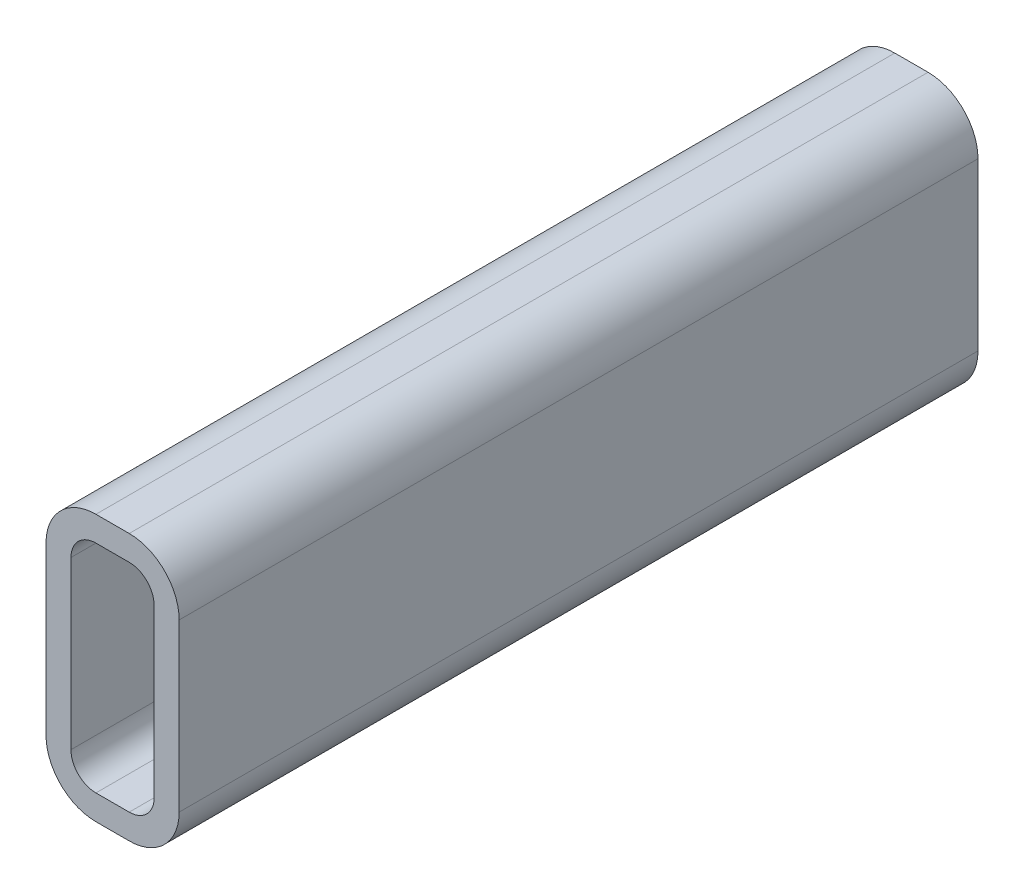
from build123d import *

# Parameters (mm, degrees)
BOSS_EXTRUDE1_DEPTH = 304.8


with BuildPart() as part:
    # Sketch1 → Boss-Extrude1 (new body)
    with BuildSketch(Plane.XY):
        with BuildLine():
            Line((19.05, 101.6), (31.75, 101.6))
            ThreePointArc((31.75, 101.6), (45.220384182, 96.020384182), (50.8, 82.55))
            Line((50.8, 82.55), (50.8, 19.05))
            ThreePointArc((50.8, 19.05), (45.220384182, 5.579615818), (31.75, 0))
            Line((31.75, 0), (19.05, 0))
            ThreePointArc((19.05, 0), (5.579615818, 5.579615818), (0, 19.05))
            Line((0, 19.05), (0, 82.55))
            ThreePointArc((0, 82.55), (5.579615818, 96.020384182), (19.05, 101.6))
        make_face()
        with BuildLine():
            Line((19.05, 92.075), (31.75, 92.075))
            ThreePointArc((31.75, 92.075), (38.485192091, 89.285192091), (41.275, 82.55))
            Line((41.275, 82.55), (41.275, 19.05))
            ThreePointArc((41.275, 19.05), (38.485192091, 12.314807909), (31.75, 9.525))
            Line((31.75, 9.525), (19.05, 9.525))
            ThreePointArc((19.05, 9.525), (12.314807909, 12.314807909), (9.525, 19.05))
            Line((9.525, 19.05), (9.525, 82.55))
            ThreePointArc((9.525, 82.55), (12.314807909, 89.285192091), (19.05, 92.075))
        make_face(mode=Mode.SUBTRACT)
    extrude(amount=BOSS_EXTRUDE1_DEPTH)


solid = part.part
